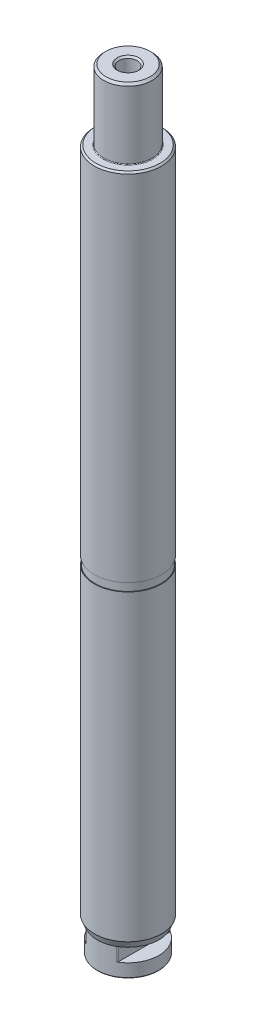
ISO-10303-21;
HEADER;
FILE_DESCRIPTION(('STEP AP214'),'2;1');
FILE_NAME('part.step','',(''),(''),'','','');
FILE_SCHEMA(('AUTOMOTIVE_DESIGN { 1 0 10303 214 1 1 1 1 }'));
ENDSEC;
DATA;
#1=APPLICATION_CONTEXT('core data for automotive mechanical design processes');
#2=APPLICATION_PROTOCOL_DEFINITION('international standard','automotive_design',2000,#1);
#3=PRODUCT_CONTEXT('',#1,'mechanical');
#4=PRODUCT('Part','Part','',(#3));
#5=PRODUCT_RELATED_PRODUCT_CATEGORY('part','',(#4));
#6=PRODUCT_DEFINITION_FORMATION('','',#4);
#7=PRODUCT_DEFINITION_CONTEXT('part definition',#1,'design');
#8=PRODUCT_DEFINITION('design','',#6,#7);
#9=PRODUCT_DEFINITION_SHAPE('','',#8);
#10=(LENGTH_UNIT() NAMED_UNIT(*) SI_UNIT(.MILLI.,.METRE.));
#11=(NAMED_UNIT(*) PLANE_ANGLE_UNIT() SI_UNIT($,.RADIAN.));
#12=(NAMED_UNIT(*) SI_UNIT($,.STERADIAN.) SOLID_ANGLE_UNIT());
#13=UNCERTAINTY_MEASURE_WITH_UNIT(LENGTH_MEASURE(1.E-05),#10,'distance_accuracy_value','');
#14=(GEOMETRIC_REPRESENTATION_CONTEXT(3) GLOBAL_UNCERTAINTY_ASSIGNED_CONTEXT((#13)) GLOBAL_UNIT_ASSIGNED_CONTEXT((#10,
#11,#12)) REPRESENTATION_CONTEXT('',''));
#15=CARTESIAN_POINT('',(0.,0.,0.));
#16=DIRECTION('',(0.,0.,1.));
#17=DIRECTION('',(1.,0.,0.));
#18=AXIS2_PLACEMENT_3D('',#15,#16,#17);
#19=CARTESIAN_POINT('',(0.,0.,0.));
#20=DIRECTION('',(0.,-1.,0.));
#21=DIRECTION('',(0.,0.,-1.));
#22=AXIS2_PLACEMENT_3D('',#19,#20,#21);
#23=CYLINDRICAL_SURFACE('',#22,11.45);
#24=CARTESIAN_POINT('',(0.,0.25,0.));
#25=DIRECTION('',(0.,-1.,0.));
#26=DIRECTION('',(0.,0.,-1.));
#27=AXIS2_PLACEMENT_3D('',#24,#25,#26);
#28=CIRCLE('',#27,11.45);
#29=CARTESIAN_POINT('',(0.,0.25,-11.45));
#30=VERTEX_POINT('',#29);
#31=EDGE_CURVE('E194',#30,#30,#28,.F.);
#32=ORIENTED_EDGE('',*,*,#31,.T.);
#33=EDGE_LOOP('',(#32));
#34=FACE_BOUND('',#33,.T.);
#35=CARTESIAN_POINT('',(0.,10.,0.));
#36=DIRECTION('',(0.,-1.,0.));
#37=DIRECTION('',(0.,0.,-1.));
#38=AXIS2_PLACEMENT_3D('',#35,#36,#37);
#39=CIRCLE('',#38,11.45);
#40=CARTESIAN_POINT('',(-5.64585253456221,10.,-9.9612674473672));
#41=VERTEX_POINT('',#40);
#42=CARTESIAN_POINT('',(5.64585253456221,10.,-9.9612674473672));
#43=VERTEX_POINT('',#42);
#44=EDGE_CURVE('E547',#41,#43,#39,.T.);
#45=ORIENTED_EDGE('',*,*,#44,.T.);
#46=DIRECTION('',(0.,-1.,0.));
#47=VECTOR('',#46,1.);
#48=CARTESIAN_POINT('',(5.64585253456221,0.,-9.9612674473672));
#49=LINE('',#48,#47);
#50=CARTESIAN_POINT('',(5.64585253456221,5.,-9.9612674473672));
#51=VERTEX_POINT('',#50);
#52=EDGE_CURVE('E155',#43,#51,#49,.T.);
#53=ORIENTED_EDGE('',*,*,#52,.T.);
#54=CARTESIAN_POINT('',(0.,5.,0.));
#55=DIRECTION('',(0.,-1.,0.));
#56=DIRECTION('',(0.,0.,-1.));
#57=AXIS2_PLACEMENT_3D('',#54,#55,#56);
#58=CIRCLE('',#57,11.45);
#59=CARTESIAN_POINT('',(5.64585253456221,5.,9.9612674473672));
#60=VERTEX_POINT('',#59);
#61=EDGE_CURVE('E181',#60,#51,#58,.F.);
#62=ORIENTED_EDGE('',*,*,#61,.F.);
#63=DIRECTION('',(0.,-1.,0.));
#64=VECTOR('',#63,1.);
#65=CARTESIAN_POINT('',(5.64585253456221,0.,9.9612674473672));
#66=LINE('',#65,#64);
#67=CARTESIAN_POINT('',(5.64585253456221,10.,9.9612674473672));
#68=VERTEX_POINT('',#67);
#69=EDGE_CURVE('E146',#60,#68,#66,.F.);
#70=ORIENTED_EDGE('',*,*,#69,.T.);
#71=CARTESIAN_POINT('',(-5.64585253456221,10.,9.9612674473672));
#72=VERTEX_POINT('',#71);
#73=EDGE_CURVE('E548',#68,#72,#39,.T.);
#74=ORIENTED_EDGE('',*,*,#73,.T.);
#75=DIRECTION('',(0.,-1.,0.));
#76=VECTOR('',#75,1.);
#77=CARTESIAN_POINT('',(-5.64585253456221,0.,9.9612674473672));
#78=LINE('',#77,#76);
#79=CARTESIAN_POINT('',(-5.64585253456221,5.,9.9612674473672));
#80=VERTEX_POINT('',#79);
#81=EDGE_CURVE('E140',#72,#80,#78,.T.);
#82=ORIENTED_EDGE('',*,*,#81,.T.);
#83=CARTESIAN_POINT('',(-5.64585253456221,5.,-9.9612674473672));
#84=VERTEX_POINT('',#83);
#85=EDGE_CURVE('E178',#84,#80,#58,.F.);
#86=ORIENTED_EDGE('',*,*,#85,.F.);
#87=DIRECTION('',(0.,-1.,0.));
#88=VECTOR('',#87,1.);
#89=CARTESIAN_POINT('',(-5.64585253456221,0.,-9.9612674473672));
#90=LINE('',#89,#88);
#91=EDGE_CURVE('E142',#84,#41,#90,.F.);
#92=ORIENTED_EDGE('',*,*,#91,.T.);
#93=EDGE_LOOP('',(#45,#53,#62,#70,#74,#82,#86,#92));
#94=FACE_BOUND('',#93,.T.);
#95=ADVANCED_FACE('F49',(#34,#94),#23,.T.);
#96=CARTESIAN_POINT('',(0.,0.,0.));
#97=DIRECTION('',(0.,-1.,0.));
#98=DIRECTION('',(0.,0.,-1.));
#99=AXIS2_PLACEMENT_3D('',#96,#97,#98);
#100=PLANE('',#99);
#101=CARTESIAN_POINT('',(0.,0.,0.));
#102=DIRECTION('',(0.,-1.,0.));
#103=DIRECTION('',(0.,0.,-1.));
#104=AXIS2_PLACEMENT_3D('',#101,#102,#103);
#105=CIRCLE('',#104,11.2);
#106=CARTESIAN_POINT('',(0.,0.,-11.2));
#107=VERTEX_POINT('',#106);
#108=EDGE_CURVE('E191',#107,#107,#105,.T.);
#109=ORIENTED_EDGE('',*,*,#108,.T.);
#110=EDGE_LOOP('',(#109));
#111=FACE_BOUND('',#110,.T.);
#112=ADVANCED_FACE('F227',(#111),#100,.T.);
#113=CARTESIAN_POINT('',(0.,10.,0.));
#114=DIRECTION('',(0.,1.,0.));
#115=DIRECTION('',(0.,0.,1.));
#116=AXIS2_PLACEMENT_3D('',#113,#114,#115);
#117=CONICAL_SURFACE('',#116,11.45,0.397627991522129);
#118=CARTESIAN_POINT('',(0.,12.5,0.));
#119=DIRECTION('',(0.,-1.,0.));
#120=DIRECTION('',(0.,0.,-1.));
#121=AXIS2_PLACEMENT_3D('',#118,#119,#120);
#122=CIRCLE('',#121,12.5);
#123=CARTESIAN_POINT('',(0.,12.5,-12.5));
#124=VERTEX_POINT('',#123);
#125=EDGE_CURVE('E546',#124,#124,#122,.T.);
#126=ORIENTED_EDGE('',*,*,#125,.T.);
#127=EDGE_LOOP('',(#126));
#128=FACE_BOUND('',#127,.T.);
#129=EDGE_CURVE('E70',#43,#68,#39,.T.);
#130=ORIENTED_EDGE('',*,*,#129,.F.);
#131=ORIENTED_EDGE('',*,*,#44,.F.);
#132=EDGE_CURVE('E64',#72,#41,#39,.T.);
#133=ORIENTED_EDGE('',*,*,#132,.F.);
#134=ORIENTED_EDGE('',*,*,#73,.F.);
#135=EDGE_LOOP('',(#130,#131,#133,#134));
#136=FACE_BOUND('',#135,.T.);
#137=ADVANCED_FACE('F233',(#128,#136),#117,.T.);
#138=CARTESIAN_POINT('',(0.,0.,0.));
#139=DIRECTION('',(0.,-1.,0.));
#140=DIRECTION('',(0.,0.,-1.));
#141=AXIS2_PLACEMENT_3D('',#138,#139,#140);
#142=CYLINDRICAL_SURFACE('',#141,12.5);
#143=CARTESIAN_POINT('',(0.,125.1,0.));
#144=DIRECTION('',(0.,-1.,0.));
#145=DIRECTION('',(0.,0.,-1.));
#146=AXIS2_PLACEMENT_3D('',#143,#144,#145);
#147=CIRCLE('',#146,12.5);
#148=CARTESIAN_POINT('',(0.,125.1,-12.5));
#149=VERTEX_POINT('',#148);
#150=EDGE_CURVE('E543',#149,#149,#147,.T.);
#151=ORIENTED_EDGE('',*,*,#150,.T.);
#152=EDGE_LOOP('',(#151));
#153=FACE_BOUND('',#152,.T.);
#154=ORIENTED_EDGE('',*,*,#125,.F.);
#155=EDGE_LOOP('',(#154));
#156=FACE_BOUND('',#155,.T.);
#157=ADVANCED_FACE('F344',(#153,#156),#142,.T.);
#158=CARTESIAN_POINT('',(12.5,125.1,0.));
#159=DIRECTION('',(0.,1.,0.));
#160=DIRECTION('',(0.,0.,1.));
#161=AXIS2_PLACEMENT_3D('',#158,#159,#160);
#162=PLANE('',#161);
#163=CARTESIAN_POINT('',(0.,125.1,0.));
#164=DIRECTION('',(0.,-1.,0.));
#165=DIRECTION('',(0.,0.,-1.));
#166=AXIS2_PLACEMENT_3D('',#163,#164,#165);
#167=CIRCLE('',#166,12.25);
#168=CARTESIAN_POINT('',(0.,125.1,-12.25));
#169=VERTEX_POINT('',#168);
#170=EDGE_CURVE('E549',#169,#169,#167,.T.);
#171=ORIENTED_EDGE('',*,*,#170,.T.);
#172=EDGE_LOOP('',(#171));
#173=FACE_BOUND('',#172,.T.);
#174=ORIENTED_EDGE('',*,*,#150,.F.);
#175=EDGE_LOOP('',(#174));
#176=FACE_BOUND('',#175,.T.);
#177=ADVANCED_FACE('F500',(#173,#176),#162,.T.);
#178=CARTESIAN_POINT('',(0.,0.,0.));
#179=DIRECTION('',(0.,-1.,0.));
#180=DIRECTION('',(0.,0.,-1.));
#181=AXIS2_PLACEMENT_3D('',#178,#179,#180);
#182=CYLINDRICAL_SURFACE('',#181,12.25);
#183=CARTESIAN_POINT('',(0.,128.1,0.));
#184=DIRECTION('',(0.,-1.,0.));
#185=DIRECTION('',(0.,0.,-1.));
#186=AXIS2_PLACEMENT_3D('',#183,#184,#185);
#187=CIRCLE('',#186,12.25);
#188=CARTESIAN_POINT('',(0.,128.1,-12.25));
#189=VERTEX_POINT('',#188);
#190=EDGE_CURVE('E554',#189,#189,#187,.T.);
#191=ORIENTED_EDGE('',*,*,#190,.T.);
#192=EDGE_LOOP('',(#191));
#193=FACE_BOUND('',#192,.T.);
#194=ORIENTED_EDGE('',*,*,#170,.F.);
#195=EDGE_LOOP('',(#194));
#196=FACE_BOUND('',#195,.T.);
#197=ADVANCED_FACE('F490',(#193,#196),#182,.T.);
#198=CARTESIAN_POINT('',(12.25,128.1,0.));
#199=DIRECTION('',(0.,-1.,0.));
#200=DIRECTION('',(0.,0.,-1.));
#201=AXIS2_PLACEMENT_3D('',#198,#199,#200);
#202=PLANE('',#201);
#203=CARTESIAN_POINT('',(0.,128.1,0.));
#204=DIRECTION('',(0.,-1.,0.));
#205=DIRECTION('',(0.,0.,-1.));
#206=AXIS2_PLACEMENT_3D('',#203,#204,#205);
#207=CIRCLE('',#206,12.5);
#208=CARTESIAN_POINT('',(0.,128.1,-12.5));
#209=VERTEX_POINT('',#208);
#210=EDGE_CURVE('E557',#209,#209,#207,.T.);
#211=ORIENTED_EDGE('',*,*,#210,.T.);
#212=EDGE_LOOP('',(#211));
#213=FACE_BOUND('',#212,.T.);
#214=ORIENTED_EDGE('',*,*,#190,.F.);
#215=EDGE_LOOP('',(#214));
#216=FACE_BOUND('',#215,.T.);
#217=ADVANCED_FACE('F481',(#213,#216),#202,.T.);
#218=CARTESIAN_POINT('',(0.,0.,0.));
#219=DIRECTION('',(0.,-1.,0.));
#220=DIRECTION('',(0.,0.,-1.));
#221=AXIS2_PLACEMENT_3D('',#218,#219,#220);
#222=CYLINDRICAL_SURFACE('',#221,12.5);
#223=CARTESIAN_POINT('',(0.,259.6,0.));
#224=DIRECTION('',(0.,1.,0.));
#225=DIRECTION('',(0.,0.,1.));
#226=AXIS2_PLACEMENT_3D('',#223,#224,#225);
#227=CIRCLE('',#226,12.5);
#228=CARTESIAN_POINT('',(0.,259.6,12.5));
#229=VERTEX_POINT('',#228);
#230=EDGE_CURVE('E197',#229,#229,#227,.F.);
#231=ORIENTED_EDGE('',*,*,#230,.T.);
#232=EDGE_LOOP('',(#231));
#233=FACE_BOUND('',#232,.T.);
#234=ORIENTED_EDGE('',*,*,#210,.F.);
#235=EDGE_LOOP('',(#234));
#236=FACE_BOUND('',#235,.T.);
#237=ADVANCED_FACE('F472',(#233,#236),#222,.T.);
#238=CARTESIAN_POINT('',(12.5,260.2,0.));
#239=DIRECTION('',(0.,1.,0.));
#240=DIRECTION('',(0.,0.,1.));
#241=AXIS2_PLACEMENT_3D('',#238,#239,#240);
#242=PLANE('',#241);
#243=CARTESIAN_POINT('',(0.,260.2,0.));
#244=DIRECTION('',(0.,1.,0.));
#245=DIRECTION('',(0.,0.,1.));
#246=AXIS2_PLACEMENT_3D('',#243,#244,#245);
#247=CIRCLE('',#246,11.9000000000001);
#248=CARTESIAN_POINT('',(0.,260.2,11.9000000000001));
#249=VERTEX_POINT('',#248);
#250=EDGE_CURVE('E200',#249,#249,#247,.T.);
#251=ORIENTED_EDGE('',*,*,#250,.T.);
#252=EDGE_LOOP('',(#251));
#253=FACE_BOUND('',#252,.T.);
#254=CARTESIAN_POINT('',(0.,260.2,0.));
#255=DIRECTION('',(0.,1.,0.));
#256=DIRECTION('',(0.,0.,1.));
#257=AXIS2_PLACEMENT_3D('',#254,#255,#256);
#258=CIRCLE('',#257,9.25);
#259=CARTESIAN_POINT('',(0.,260.2,9.25));
#260=VERTEX_POINT('',#259);
#261=EDGE_CURVE('E180',#260,#260,#258,.F.);
#262=ORIENTED_EDGE('',*,*,#261,.T.);
#263=EDGE_LOOP('',(#262));
#264=FACE_BOUND('',#263,.T.);
#265=ADVANCED_FACE('F271',(#253,#264),#242,.T.);
#266=CARTESIAN_POINT('',(0.,0.,0.));
#267=DIRECTION('',(0.,-1.,0.));
#268=DIRECTION('',(0.,0.,-1.));
#269=AXIS2_PLACEMENT_3D('',#266,#267,#268);
#270=CYLINDRICAL_SURFACE('',#269,9.);
#271=CARTESIAN_POINT('',(0.,285.4,0.));
#272=DIRECTION('',(0.,1.,0.));
#273=DIRECTION('',(0.,0.,1.));
#274=AXIS2_PLACEMENT_3D('',#271,#272,#273);
#275=CIRCLE('',#274,9.);
#276=CARTESIAN_POINT('',(0.,285.4,9.));
#277=VERTEX_POINT('',#276);
#278=EDGE_CURVE('E149',#277,#277,#275,.F.);
#279=ORIENTED_EDGE('',*,*,#278,.T.);
#280=EDGE_LOOP('',(#279));
#281=FACE_BOUND('',#280,.T.);
#282=CARTESIAN_POINT('',(0.,260.45,0.));
#283=DIRECTION('',(0.,1.,0.));
#284=DIRECTION('',(0.,0.,1.));
#285=AXIS2_PLACEMENT_3D('',#282,#283,#284);
#286=CIRCLE('',#285,9.);
#287=CARTESIAN_POINT('',(0.,260.45,9.));
#288=VERTEX_POINT('',#287);
#289=EDGE_CURVE('E184',#288,#288,#286,.T.);
#290=ORIENTED_EDGE('',*,*,#289,.T.);
#291=EDGE_LOOP('',(#290));
#292=FACE_BOUND('',#291,.T.);
#293=ADVANCED_FACE('F205',(#281,#292),#270,.T.);
#294=CARTESIAN_POINT('',(9.,286.2,0.));
#295=DIRECTION('',(0.,1.,0.));
#296=DIRECTION('',(0.,0.,1.));
#297=AXIS2_PLACEMENT_3D('',#294,#295,#296);
#298=PLANE('',#297);
#299=CARTESIAN_POINT('',(0.,286.2,0.));
#300=DIRECTION('',(0.,1.,0.));
#301=DIRECTION('',(0.,0.,1.));
#302=AXIS2_PLACEMENT_3D('',#299,#300,#301);
#303=CIRCLE('',#302,4.025);
#304=CARTESIAN_POINT('',(0.,286.2,4.025));
#305=VERTEX_POINT('',#304);
#306=EDGE_CURVE('E571',#305,#305,#303,.T.);
#307=ORIENTED_EDGE('',*,*,#306,.F.);
#308=EDGE_LOOP('',(#307));
#309=FACE_BOUND('',#308,.T.);
#310=CARTESIAN_POINT('',(0.,286.2,0.));
#311=DIRECTION('',(0.,1.,0.));
#312=DIRECTION('',(0.,0.,1.));
#313=AXIS2_PLACEMENT_3D('',#310,#311,#312);
#314=CIRCLE('',#313,8.20000000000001);
#315=CARTESIAN_POINT('',(0.,286.2,8.20000000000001));
#316=VERTEX_POINT('',#315);
#317=EDGE_CURVE('E143',#316,#316,#314,.T.);
#318=ORIENTED_EDGE('',*,*,#317,.T.);
#319=EDGE_LOOP('',(#318));
#320=FACE_BOUND('',#319,.T.);
#321=ADVANCED_FACE('F278',(#309,#320),#298,.T.);
#322=CARTESIAN_POINT('',(0.,10.,0.));
#323=DIRECTION('',(0.,-1.,0.));
#324=DIRECTION('',(0.,0.,-1.));
#325=AXIS2_PLACEMENT_3D('',#322,#323,#324);
#326=PLANE('',#325);
#327=DIRECTION('',(0.,0.,1.));
#328=VECTOR('',#327,1.);
#329=CARTESIAN_POINT('',(5.95,10.,-12.5));
#330=LINE('',#329,#328);
#331=CARTESIAN_POINT('',(5.95,10.,-9.43927963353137));
#332=VERTEX_POINT('',#331);
#333=CARTESIAN_POINT('',(5.95,10.,9.43927963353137));
#334=VERTEX_POINT('',#333);
#335=EDGE_CURVE('E136',#332,#334,#330,.T.);
#336=ORIENTED_EDGE('',*,*,#335,.F.);
#337=CARTESIAN_POINT('',(5.35,10.,-9.43927963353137));
#338=DIRECTION('',(0.,-1.,0.));
#339=DIRECTION('',(0.,0.,-1.));
#340=AXIS2_PLACEMENT_3D('',#337,#338,#339);
#341=CIRCLE('',#340,0.6);
#342=EDGE_CURVE('E164',#332,#43,#341,.F.);
#343=ORIENTED_EDGE('',*,*,#342,.T.);
#344=ORIENTED_EDGE('',*,*,#129,.T.);
#345=CARTESIAN_POINT('',(5.35,10.,9.43927963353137));
#346=DIRECTION('',(0.,-1.,0.));
#347=DIRECTION('',(0.,0.,-1.));
#348=AXIS2_PLACEMENT_3D('',#345,#346,#347);
#349=CIRCLE('',#348,0.6);
#350=EDGE_CURVE('E167',#68,#334,#349,.F.);
#351=ORIENTED_EDGE('',*,*,#350,.T.);
#352=EDGE_LOOP('',(#336,#343,#344,#351));
#353=FACE_BOUND('',#352,.T.);
#354=ADVANCED_FACE('F294',(#353),#326,.T.);
#355=CARTESIAN_POINT('',(5.95,10.,-12.5));
#356=DIRECTION('',(1.,0.,0.));
#357=DIRECTION('',(0.,0.,-1.));
#358=AXIS2_PLACEMENT_3D('',#355,#356,#357);
#359=PLANE('',#358);
#360=DIRECTION('',(0.,0.,1.));
#361=VECTOR('',#360,1.);
#362=CARTESIAN_POINT('',(5.95,5.,-12.5));
#363=LINE('',#362,#361);
#364=CARTESIAN_POINT('',(5.95,5.,-9.43927963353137));
#365=VERTEX_POINT('',#364);
#366=CARTESIAN_POINT('',(5.95,5.,9.43927963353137));
#367=VERTEX_POINT('',#366);
#368=EDGE_CURVE('E137',#365,#367,#363,.T.);
#369=ORIENTED_EDGE('',*,*,#368,.F.);
#370=DIRECTION('',(0.,-1.,0.));
#371=VECTOR('',#370,1.);
#372=CARTESIAN_POINT('',(5.95,10.,-9.43927963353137));
#373=LINE('',#372,#371);
#374=EDGE_CURVE('E131',#365,#332,#373,.F.);
#375=ORIENTED_EDGE('',*,*,#374,.T.);
#376=ORIENTED_EDGE('',*,*,#335,.T.);
#377=DIRECTION('',(0.,-1.,0.));
#378=VECTOR('',#377,1.);
#379=CARTESIAN_POINT('',(5.95,10.,9.43927963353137));
#380=LINE('',#379,#378);
#381=EDGE_CURVE('E158',#334,#367,#380,.T.);
#382=ORIENTED_EDGE('',*,*,#381,.T.);
#383=EDGE_LOOP('',(#369,#375,#376,#382));
#384=FACE_BOUND('',#383,.T.);
#385=ADVANCED_FACE('F355',(#384),#359,.T.);
#386=CARTESIAN_POINT('',(0.,5.,0.));
#387=DIRECTION('',(0.,-1.,0.));
#388=DIRECTION('',(0.,0.,-1.));
#389=AXIS2_PLACEMENT_3D('',#386,#387,#388);
#390=PLANE('',#389);
#391=ORIENTED_EDGE('',*,*,#61,.T.);
#392=CARTESIAN_POINT('',(5.35,5.,-9.43927963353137));
#393=DIRECTION('',(0.,-1.,0.));
#394=DIRECTION('',(0.,0.,-1.));
#395=AXIS2_PLACEMENT_3D('',#392,#393,#394);
#396=CIRCLE('',#395,0.6);
#397=EDGE_CURVE('E162',#51,#365,#396,.T.);
#398=ORIENTED_EDGE('',*,*,#397,.T.);
#399=ORIENTED_EDGE('',*,*,#368,.T.);
#400=CARTESIAN_POINT('',(5.35,5.,9.43927963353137));
#401=DIRECTION('',(0.,-1.,0.));
#402=DIRECTION('',(0.,0.,-1.));
#403=AXIS2_PLACEMENT_3D('',#400,#401,#402);
#404=CIRCLE('',#403,0.6);
#405=EDGE_CURVE('E169',#367,#60,#404,.T.);
#406=ORIENTED_EDGE('',*,*,#405,.T.);
#407=EDGE_LOOP('',(#391,#398,#399,#406));
#408=FACE_BOUND('',#407,.T.);
#409=ADVANCED_FACE('F366',(#408),#390,.F.);
#410=ORIENTED_EDGE('',*,*,#85,.T.);
#411=CARTESIAN_POINT('',(-5.35,5.,9.43927963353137));
#412=DIRECTION('',(0.,-1.,0.));
#413=DIRECTION('',(0.,0.,-1.));
#414=AXIS2_PLACEMENT_3D('',#411,#412,#413);
#415=CIRCLE('',#414,0.6);
#416=CARTESIAN_POINT('',(-5.95,5.,9.43927963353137));
#417=VERTEX_POINT('',#416);
#418=EDGE_CURVE('E57',#80,#417,#415,.T.);
#419=ORIENTED_EDGE('',*,*,#418,.T.);
#420=DIRECTION('',(0.,0.,-1.));
#421=VECTOR('',#420,1.);
#422=CARTESIAN_POINT('',(-5.95,5.,-12.5));
#423=LINE('',#422,#421);
#424=CARTESIAN_POINT('',(-5.95,5.,-9.43927963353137));
#425=VERTEX_POINT('',#424);
#426=EDGE_CURVE('E126',#417,#425,#423,.T.);
#427=ORIENTED_EDGE('',*,*,#426,.T.);
#428=CARTESIAN_POINT('',(-5.35,5.,-9.43927963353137));
#429=DIRECTION('',(0.,-1.,0.));
#430=DIRECTION('',(0.,0.,-1.));
#431=AXIS2_PLACEMENT_3D('',#428,#429,#430);
#432=CIRCLE('',#431,0.6);
#433=EDGE_CURVE('E173',#425,#84,#432,.T.);
#434=ORIENTED_EDGE('',*,*,#433,.T.);
#435=EDGE_LOOP('',(#410,#419,#427,#434));
#436=FACE_BOUND('',#435,.T.);
#437=ADVANCED_FACE('F176',(#436),#390,.F.);
#438=DIRECTION('',(0.,0.,-1.));
#439=VECTOR('',#438,1.);
#440=CARTESIAN_POINT('',(-5.95,10.,-12.5));
#441=LINE('',#440,#439);
#442=CARTESIAN_POINT('',(-5.95,10.,9.43927963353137));
#443=VERTEX_POINT('',#442);
#444=CARTESIAN_POINT('',(-5.95,10.,-9.43927963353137));
#445=VERTEX_POINT('',#444);
#446=EDGE_CURVE('E123',#443,#445,#441,.T.);
#447=ORIENTED_EDGE('',*,*,#446,.F.);
#448=CARTESIAN_POINT('',(-5.35,10.,9.43927963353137));
#449=DIRECTION('',(0.,-1.,0.));
#450=DIRECTION('',(0.,0.,-1.));
#451=AXIS2_PLACEMENT_3D('',#448,#449,#450);
#452=CIRCLE('',#451,0.6);
#453=EDGE_CURVE('E12',#443,#72,#452,.F.);
#454=ORIENTED_EDGE('',*,*,#453,.T.);
#455=ORIENTED_EDGE('',*,*,#132,.T.);
#456=CARTESIAN_POINT('',(-5.35,10.,-9.43927963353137));
#457=DIRECTION('',(0.,-1.,0.));
#458=DIRECTION('',(0.,0.,-1.));
#459=AXIS2_PLACEMENT_3D('',#456,#457,#458);
#460=CIRCLE('',#459,0.6);
#461=EDGE_CURVE('E135',#41,#445,#460,.F.);
#462=ORIENTED_EDGE('',*,*,#461,.T.);
#463=EDGE_LOOP('',(#447,#454,#455,#462));
#464=FACE_BOUND('',#463,.T.);
#465=ADVANCED_FACE('F133',(#464),#326,.T.);
#466=CARTESIAN_POINT('',(-5.95,10.,-12.5));
#467=DIRECTION('',(-1.,0.,0.));
#468=DIRECTION('',(0.,0.,1.));
#469=AXIS2_PLACEMENT_3D('',#466,#467,#468);
#470=PLANE('',#469);
#471=ORIENTED_EDGE('',*,*,#446,.T.);
#472=DIRECTION('',(0.,-1.,0.));
#473=VECTOR('',#472,1.);
#474=CARTESIAN_POINT('',(-5.95,10.,-9.43927963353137));
#475=LINE('',#474,#473);
#476=EDGE_CURVE('E130',#445,#425,#475,.T.);
#477=ORIENTED_EDGE('',*,*,#476,.T.);
#478=ORIENTED_EDGE('',*,*,#426,.F.);
#479=DIRECTION('',(0.,-1.,0.));
#480=VECTOR('',#479,1.);
#481=CARTESIAN_POINT('',(-5.95,10.,9.43927963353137));
#482=LINE('',#481,#480);
#483=EDGE_CURVE('E120',#417,#443,#482,.F.);
#484=ORIENTED_EDGE('',*,*,#483,.T.);
#485=EDGE_LOOP('',(#471,#477,#478,#484));
#486=FACE_BOUND('',#485,.T.);
#487=ADVANCED_FACE('F122',(#486),#470,.T.);
#488=CARTESIAN_POINT('',(0.,260.45,0.));
#489=DIRECTION('',(0.,1.,0.));
#490=DIRECTION('',(0.,0.,1.));
#491=AXIS2_PLACEMENT_3D('',#488,#489,#490);
#492=TOROIDAL_SURFACE('',#491,9.25,0.25);
#493=ORIENTED_EDGE('',*,*,#289,.F.);
#494=EDGE_LOOP('',(#493));
#495=FACE_BOUND('',#494,.T.);
#496=ORIENTED_EDGE('',*,*,#261,.F.);
#497=EDGE_LOOP('',(#496));
#498=FACE_BOUND('',#497,.T.);
#499=ADVANCED_FACE('F239',(#495,#498),#492,.F.);
#500=CARTESIAN_POINT('',(0.,0.25,0.));
#501=DIRECTION('',(0.,-1.,0.));
#502=DIRECTION('',(0.,0.,-1.));
#503=AXIS2_PLACEMENT_3D('',#500,#501,#502);
#504=TOROIDAL_SURFACE('',#503,11.2,0.25);
#505=ORIENTED_EDGE('',*,*,#31,.F.);
#506=EDGE_LOOP('',(#505));
#507=FACE_BOUND('',#506,.T.);
#508=ORIENTED_EDGE('',*,*,#108,.F.);
#509=EDGE_LOOP('',(#508));
#510=FACE_BOUND('',#509,.T.);
#511=ADVANCED_FACE('F220',(#507,#510),#504,.T.);
#512=CARTESIAN_POINT('',(0.,259.6,0.));
#513=DIRECTION('',(0.,-1.,0.));
#514=DIRECTION('',(0.,0.,-1.));
#515=AXIS2_PLACEMENT_3D('',#512,#513,#514);
#516=CONICAL_SURFACE('',#515,12.5,0.785398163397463);
#517=ORIENTED_EDGE('',*,*,#250,.F.);
#518=EDGE_LOOP('',(#517));
#519=FACE_BOUND('',#518,.T.);
#520=ORIENTED_EDGE('',*,*,#230,.F.);
#521=EDGE_LOOP('',(#520));
#522=FACE_BOUND('',#521,.T.);
#523=ADVANCED_FACE('F211',(#519,#522),#516,.T.);
#524=CARTESIAN_POINT('',(0.,285.4,0.));
#525=DIRECTION('',(0.,-1.,0.));
#526=DIRECTION('',(0.,0.,-1.));
#527=AXIS2_PLACEMENT_3D('',#524,#525,#526);
#528=CONICAL_SURFACE('',#527,9.,0.785398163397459);
#529=ORIENTED_EDGE('',*,*,#317,.F.);
#530=EDGE_LOOP('',(#529));
#531=FACE_BOUND('',#530,.T.);
#532=ORIENTED_EDGE('',*,*,#278,.F.);
#533=EDGE_LOOP('',(#532));
#534=FACE_BOUND('',#533,.T.);
#535=ADVANCED_FACE('F208',(#531,#534),#528,.T.);
#536=CARTESIAN_POINT('',(0.,257.2,0.));
#537=DIRECTION('',(0.,1.,0.));
#538=DIRECTION('',(0.,0.,1.));
#539=AXIS2_PLACEMENT_3D('',#536,#537,#538);
#540=CONICAL_SURFACE('',#539,3.39999999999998,1.02974425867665);
#541=CARTESIAN_POINT('',(0.,255.157073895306,0.));
#542=VERTEX_POINT('',#541);
#543=VERTEX_LOOP('',#542);
#544=FACE_BOUND('',#543,.T.);
#545=CARTESIAN_POINT('',(0.,257.2,0.));
#546=DIRECTION('',(0.,1.,0.));
#547=DIRECTION('',(0.,0.,1.));
#548=AXIS2_PLACEMENT_3D('',#545,#546,#547);
#549=CIRCLE('',#548,3.39999999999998);
#550=CARTESIAN_POINT('',(0.,257.2,3.39999999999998));
#551=VERTEX_POINT('',#550);
#552=EDGE_CURVE('E563',#551,#551,#549,.T.);
#553=ORIENTED_EDGE('',*,*,#552,.T.);
#554=EDGE_LOOP('',(#553));
#555=FACE_BOUND('',#554,.T.);
#556=ADVANCED_FACE('F210',(#544,#555),#540,.F.);
#557=CARTESIAN_POINT('',(0.,286.2,0.));
#558=DIRECTION('',(0.,1.,0.));
#559=DIRECTION('',(0.,0.,1.));
#560=AXIS2_PLACEMENT_3D('',#557,#558,#559);
#561=CYLINDRICAL_SURFACE('',#560,3.39999999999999);
#562=ORIENTED_EDGE('',*,*,#552,.F.);
#563=EDGE_LOOP('',(#562));
#564=FACE_BOUND('',#563,.T.);
#565=CARTESIAN_POINT('',(0.,285.575,0.));
#566=DIRECTION('',(0.,1.,0.));
#567=DIRECTION('',(0.,0.,1.));
#568=AXIS2_PLACEMENT_3D('',#565,#566,#567);
#569=CIRCLE('',#568,3.4);
#570=CARTESIAN_POINT('',(0.,285.575,3.4));
#571=VERTEX_POINT('',#570);
#572=EDGE_CURVE('E568',#571,#571,#569,.T.);
#573=ORIENTED_EDGE('',*,*,#572,.T.);
#574=EDGE_LOOP('',(#573));
#575=FACE_BOUND('',#574,.T.);
#576=ADVANCED_FACE('F218',(#564,#575),#561,.F.);
#577=CARTESIAN_POINT('',(0.,286.2,0.));
#578=DIRECTION('',(0.,1.,0.));
#579=DIRECTION('',(0.,0.,1.));
#580=AXIS2_PLACEMENT_3D('',#577,#578,#579);
#581=CONICAL_SURFACE('',#580,4.025,0.785398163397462);
#582=ORIENTED_EDGE('',*,*,#572,.F.);
#583=EDGE_LOOP('',(#582));
#584=FACE_BOUND('',#583,.T.);
#585=ORIENTED_EDGE('',*,*,#306,.T.);
#586=EDGE_LOOP('',(#585));
#587=FACE_BOUND('',#586,.T.);
#588=ADVANCED_FACE('F314',(#584,#587),#581,.F.);
#589=CARTESIAN_POINT('',(5.35,0.,-9.43927963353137));
#590=DIRECTION('',(0.,-1.,0.));
#591=DIRECTION('',(0.,0.,-1.));
#592=AXIS2_PLACEMENT_3D('',#589,#590,#591);
#593=CYLINDRICAL_SURFACE('',#592,0.6);
#594=ORIENTED_EDGE('',*,*,#342,.F.);
#595=ORIENTED_EDGE('',*,*,#374,.F.);
#596=ORIENTED_EDGE('',*,*,#397,.F.);
#597=ORIENTED_EDGE('',*,*,#52,.F.);
#598=EDGE_LOOP('',(#594,#595,#596,#597));
#599=FACE_BOUND('',#598,.T.);
#600=ADVANCED_FACE('F325',(#599),#593,.T.);
#601=CARTESIAN_POINT('',(5.35,0.,9.43927963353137));
#602=DIRECTION('',(0.,-1.,0.));
#603=DIRECTION('',(0.,0.,-1.));
#604=AXIS2_PLACEMENT_3D('',#601,#602,#603);
#605=CYLINDRICAL_SURFACE('',#604,0.6);
#606=ORIENTED_EDGE('',*,*,#405,.F.);
#607=ORIENTED_EDGE('',*,*,#381,.F.);
#608=ORIENTED_EDGE('',*,*,#350,.F.);
#609=ORIENTED_EDGE('',*,*,#69,.F.);
#610=EDGE_LOOP('',(#606,#607,#608,#609));
#611=FACE_BOUND('',#610,.T.);
#612=ADVANCED_FACE('F410',(#611),#605,.T.);
#613=CARTESIAN_POINT('',(-5.35,0.,-9.43927963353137));
#614=DIRECTION('',(0.,-1.,0.));
#615=DIRECTION('',(0.,0.,-1.));
#616=AXIS2_PLACEMENT_3D('',#613,#614,#615);
#617=CYLINDRICAL_SURFACE('',#616,0.6);
#618=ORIENTED_EDGE('',*,*,#433,.F.);
#619=ORIENTED_EDGE('',*,*,#476,.F.);
#620=ORIENTED_EDGE('',*,*,#461,.F.);
#621=ORIENTED_EDGE('',*,*,#91,.F.);
#622=EDGE_LOOP('',(#618,#619,#620,#621));
#623=FACE_BOUND('',#622,.T.);
#624=ADVANCED_FACE('F420',(#623),#617,.T.);
#625=CARTESIAN_POINT('',(-5.35,0.,9.43927963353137));
#626=DIRECTION('',(0.,-1.,0.));
#627=DIRECTION('',(0.,0.,-1.));
#628=AXIS2_PLACEMENT_3D('',#625,#626,#627);
#629=CYLINDRICAL_SURFACE('',#628,0.6);
#630=ORIENTED_EDGE('',*,*,#453,.F.);
#631=ORIENTED_EDGE('',*,*,#483,.F.);
#632=ORIENTED_EDGE('',*,*,#418,.F.);
#633=ORIENTED_EDGE('',*,*,#81,.F.);
#634=EDGE_LOOP('',(#630,#631,#632,#633));
#635=FACE_BOUND('',#634,.T.);
#636=ADVANCED_FACE('F51',(#635),#629,.T.);
#637=CLOSED_SHELL('',(#95,#112,#137,#157,#177,#197,#217,#237,#265,#293,#321,#354,#385,#409,#437,
#465,#487,#499,#511,#523,#535,#556,#576,#588,#600,#612,#624,#636));
#638=MANIFOLD_SOLID_BREP('B2',#637);
#639=ADVANCED_BREP_SHAPE_REPRESENTATION('',(#18,#638),#14);
#640=SHAPE_DEFINITION_REPRESENTATION(#9,#639);
ENDSEC;
END-ISO-10303-21;
